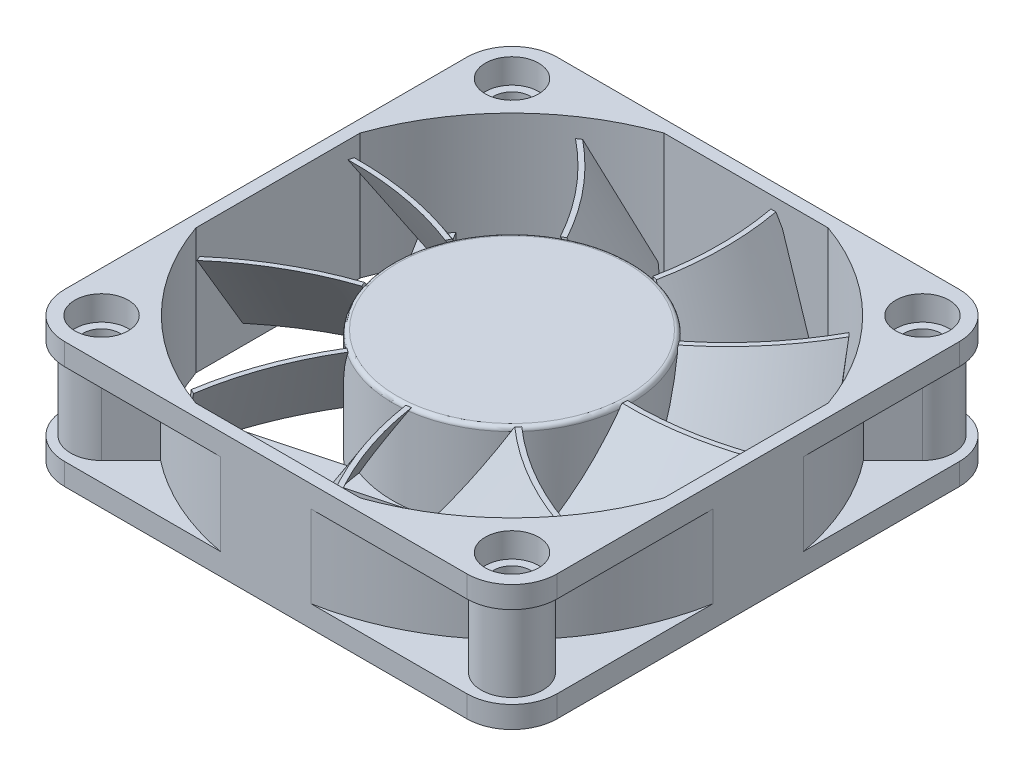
from build123d import *
from build123d.topology import SkipClean

# Parameters (mm, degrees)
SALIENTE_EXTRUIR1_DEPTH = 7.65
CROQUIS2_R              = 2.25
CORTAR_EXTRUIR1_DEPTH   = 46.100886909
CORTAR_EXTRUIR2_DEPTH   = 5
CROQUIS6_R              = 3.25
CORTAR_EXTRUIR3_DEPTH   = 3
SALIENTE_EXTRUIR2_START = -3
SALIENTE_EXTRUIR2_DEPTH = 3
CROQUIS8_R              = 14.5
SALIENTE_EXTRUIR3_DEPTH = 10.8
REDONDEO1_R             = 0.5
MATRIZC1_COUNT          = 9


with BuildPart() as part:
    # Croquis1 → Saliente-Extruir1 (new, symmetric)
    with BuildSketch(Plane(origin=(0, 0, 0), x_dir=(1, 0, 0), z_dir=(0, 1, 0))):
        with BuildLine():
            Line((-24.5, -30), (24.5, -30))
            ThreePointArc((24.5, -30), (28.389087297, -28.389087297), (30, -24.5))
            Line((30, -24.5), (30, 24.5))
            ThreePointArc((30, 24.5), (28.389087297, 28.389087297), (24.5, 30))
            Line((24.5, 30), (-24.5, 30))
            ThreePointArc((-24.5, 30), (-28.389087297, 28.389087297), (-30, 24.5))
            Line((-30, 24.5), (-30, -24.5))
            ThreePointArc((-30, -24.5), (-28.389087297, -28.389087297), (-24.5, -30))
        make_face()
    extrude(amount=SALIENTE_EXTRUIR1_DEPTH, both=True)

    # Croquis2 → Cortar-Extruir1 (cut, through all)
    with BuildSketch(Plane(origin=(0, 7.65, 0), x_dir=(1, 0, 0), z_dir=(0, 1, 0))):
        with Locations(Location((-25, -25, 0), (0, 0, 270))):
            Circle(CROQUIS2_R)
        with Locations(Location((-25, 25, 0), (0, 0, 270))):
            Circle(CROQUIS2_R)
        with Locations(Location((25, 25, 0), (0, 0, 270))):
            Circle(CROQUIS2_R)
        with BuildLine():
            Line((10, -28.5), (-10, -28.5))
            ThreePointArc((-10, -28.5), (-21.357083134, -21.357083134), (-28.5, -10))
            Line((-28.5, -10), (-28.5, 10))
            ThreePointArc((-28.5, 10), (-21.357083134, 21.357083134), (-10, 28.5))
            Line((-10, 28.5), (10, 28.5))
            ThreePointArc((10, 28.5), (21.357083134, 21.357083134), (28.5, 10))
            Line((28.5, 10), (28.5, -10))
            ThreePointArc((28.5, -10), (21.357083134, -21.357083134), (10, -28.5))
        make_face()
        with Locations(Location((25, -25, 0), (0, 0, 270))):
            Circle(CROQUIS2_R)
    extrude(amount=-CORTAR_EXTRUIR1_DEPTH, mode=Mode.SUBTRACT)

    # Croquis3 → Cortar-Extruir2 (cut, symmetric)
    with BuildSketch(Plane(origin=(0, 0, 0), x_dir=(1, 0, 0), z_dir=(0, 1, 0))):
        with BuildLine():
            ThreePointArc((-22.348349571, -27.651650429), (-27.651650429, -27.651650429), (-27.651650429, -22.348349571))
            Line((-27.651650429, -22.348349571), (-24.054775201, -18.751474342))
            ThreePointArc((-24.054775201, -18.751474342), (-27.827685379, -12.4847878), (-30, -5.5))
            Line((-30, -5.5), (-30, -24.5))
            ThreePointArc((-30, -24.5), (-28.389087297, -28.389087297), (-24.5, -30))
            Line((-24.5, -30), (-5.5, -30))
            ThreePointArc((-5.5, -30), (-12.4847878, -27.827685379), (-18.751474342, -24.054775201))
            Line((-18.751474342, -24.054775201), (-22.348349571, -27.651650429))
        make_face()
        with BuildLine():
            Line((-30, 24.5), (-30, 5.5))
            ThreePointArc((-30, 5.5), (-27.827685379, 12.4847878), (-24.054775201, 18.751474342))
            Line((-24.054775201, 18.751474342), (-27.651650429, 22.348349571))
            ThreePointArc((-27.651650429, 22.348349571), (-27.651650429, 27.651650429), (-22.348349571, 27.651650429))
            Line((-22.348349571, 27.651650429), (-18.751474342, 24.054775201))
            ThreePointArc((-18.751474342, 24.054775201), (-12.4847878, 27.827685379), (-5.5, 30))
            Line((-5.5, 30), (-24.5, 30))
            ThreePointArc((-24.5, 30), (-28.389087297, 28.389087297), (-30, 24.5))
        make_face()
        with BuildLine():
            ThreePointArc((18.751474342, -24.054775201), (12.4847878, -27.827685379), (5.5, -30))
            Line((5.5, -30), (24.5, -30))
            ThreePointArc((24.5, -30), (28.389087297, -28.389087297), (30, -24.5))
            Line((30, -24.5), (30, -5.5))
            ThreePointArc((30, -5.5), (27.827685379, -12.4847878), (24.054775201, -18.751474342))
            Line((24.054775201, -18.751474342), (27.651650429, -22.348349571))
            ThreePointArc((27.651650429, -22.348349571), (27.651650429, -27.651650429), (22.348349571, -27.651650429))
            Line((22.348349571, -27.651650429), (18.751474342, -24.054775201))
        make_face()
        with BuildLine():
            Line((24.5, 30), (5.5, 30))
            ThreePointArc((5.5, 30), (12.4847878, 27.827685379), (18.751474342, 24.054775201))
            Line((18.751474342, 24.054775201), (22.348349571, 27.651650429))
            ThreePointArc((22.348349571, 27.651650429), (27.651650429, 27.651650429), (27.651650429, 22.348349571))
            Line((27.651650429, 22.348349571), (24.054775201, 18.751474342))
            ThreePointArc((24.054775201, 18.751474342), (27.827685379, 12.4847878), (30, 5.5))
            Line((30, 5.5), (30, 24.5))
            ThreePointArc((30, 24.5), (28.389087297, 28.389087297), (24.5, 30))
        make_face()
    extrude(amount=CORTAR_EXTRUIR2_DEPTH, both=True, mode=Mode.SUBTRACT)

    # Croquis6 → Cortar-Extruir3 (cut)
    with BuildSketch(Plane(origin=(0, 7.65, 0), x_dir=(1, 0, 0), z_dir=(0, 1, 0))):
        with Locations(Location((25, -25, 0), (0, 0, 270))):
            Circle(CROQUIS6_R)
        with Locations(Location((-25, -25, 0), (0, 0, 270))):
            Circle(CROQUIS6_R)
        with Locations(Location((-25, 25, 0), (0, 0, 270))):
            Circle(CROQUIS6_R)
        with Locations(Location((25, 25, 0), (0, 0, 270))):
            Circle(CROQUIS6_R)
    extrude(amount=-CORTAR_EXTRUIR3_DEPTH, mode=Mode.SUBTRACT)

    # Croquis7 → Saliente-Extruir2 (add)
    with BuildSketch(Plane.XZ.offset(7.65).offset(SALIENTE_EXTRUIR2_START)):
        with BuildLine():
            Line((21.884229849, -20.816591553), (-2.5, -14.282856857))
            ThreePointArc((-2.5, -14.282856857), (-10.623651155, -9.86853769), (-14.428116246, -1.442033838))
            Line((-14.428116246, -1.442033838), (-24.49576886, -17.66938901))
            ThreePointArc((-24.49576886, -17.66938901), (-25.431150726, -16.294372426), (-26.289434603, -14.869957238))
            Line((-26.289434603, -14.869957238), (-12.321312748, 7.6442954))
            ThreePointArc((-12.321312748, 7.6442954), (-9.42414533, 11.019776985), (-5.640034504, 13.358143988))
            Line((-5.640034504, 13.358143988), (-24.037630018, 18.287764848))
            ThreePointArc((-24.037630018, 18.287764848), (-22.995717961, 19.58180164), (-21.884229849, 20.816591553))
            Line((-21.884229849, 20.816591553), (2.5, 14.282856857))
            ThreePointArc((2.5, 14.282856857), (9.066480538, 11.315870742), (13.393974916, 5.554406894))
            Line((13.393974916, 5.554406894), (18.33656955, 24.000421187))
            ThreePointArc((18.33656955, 24.000421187), (19.629744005, 22.954806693), (20.863408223, 21.839601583))
            Line((20.863408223, 21.839601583), (14.005924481, -3.752876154))
            ThreePointArc((14.005924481, -3.752876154), (10.934176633, -9.523328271), (5.640034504, -13.358143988))
            Line((5.640034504, -13.358143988), (24.037630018, -18.287764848))
            ThreePointArc((24.037630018, -18.287764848), (22.995717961, -19.58180164), (21.884229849, -20.816591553))
        make_face()
    extrude(amount=SALIENTE_EXTRUIR2_DEPTH)



with BuildPart() as body_2:
    # Croquis8 → Saliente-Extruir3 (new body)
    with BuildSketch(Plane(origin=(0, -4.65, 0), x_dir=(1, 0, 0), z_dir=(0, 1, 0))):
        with Locations(Location((0, 0, 0), (0, 0, 90))):
            Circle(CROQUIS8_R)
    extrude(amount=SALIENTE_EXTRUIR3_DEPTH)

    # Redondeo1
    redondeo1_edges = [body_2.edges().sort_by_distance(p)[0] for p in [
        (0, 6.15, 14.5),
    ]]
    fillet(redondeo1_edges, radius=REDONDEO1_R)


with BuildPart() as part_1:
    with SkipClean():  # the faces are left unmerged after this step: merging them gives an invalid solid
        add(part.part)

        add(body_2.part)  # Recubrir1 merges body 2
        # Croquis9 for Recubrir1 → Recubrir1 section 0
        with BuildSketch(Plane(origin=(0, -4.65, 0), x_dir=(1, 0, 0), z_dir=(0, 1, 0))):
            with BuildLine():
                # circular arc as an exact rational Bezier (weights 1, cos(half-angle), 1)
                Bezier((-0.69299904, -28.3), (-4.588393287, -21.299835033), (-5.640034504, -13.358143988), weights=[1, 0.982366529, 1])
                Bezier((-5.640034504, -13.358143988), (-5.323013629, -13.491995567), (-5, -13.610657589), weights=[1, 0.999718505, 1])
                Bezier((-5, -13.610657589), (-3.899575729, -21.435687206), (0, -28.30848367), weights=[1, 0.982343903, 1])
                Bezier((0, -28.30848367), (-0.346551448, -28.30848367), (-0.69299904, -28.3), weights=[1, 0.999925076, 1])
            make_face()
        # Croquis10 for Recubrir1 → Recubrir1 section 1
        with BuildSketch(Plane(origin=(0, 6.15, 0), x_dir=(1, 0, 0), z_dir=(0, 1, 0))):
            with BuildLine():
                Bezier((6.483905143, -28.3), (2.627001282, -21.851294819), (1.5, -14.422205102), weights=[1, 0.981196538, 1])
                Bezier((1.5, -14.422205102), (1.79855865, -14.391153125), (2.095576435, -14.347771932), weights=[1, 0.999785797, 1])
                Bezier((2.095576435, -14.347771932), (3.221373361, -21.748034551), (7.095576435, -28.152865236), weights=[1, 0.98075261, 1])
                Bezier((7.095576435, -28.152865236), (6.790537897, -28.229746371), (6.483905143, -28.3), weights=[1, 0.999941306, 1])
            make_face()
        recubrir1 = loft()

    # MatrizC1: Recubrir1 ×9 about axis
    with SkipClean():  # the faces are left unmerged after this step: merging them gives an invalid solid
        matrizc1_axis = Axis((0, -4.65, 0), (0, -1, 0))
        for i in range(1, MATRIZC1_COUNT):
            add(recubrir1.rotate(matrizc1_axis, i * 360 / MATRIZC1_COUNT))


solid = part_1.part
